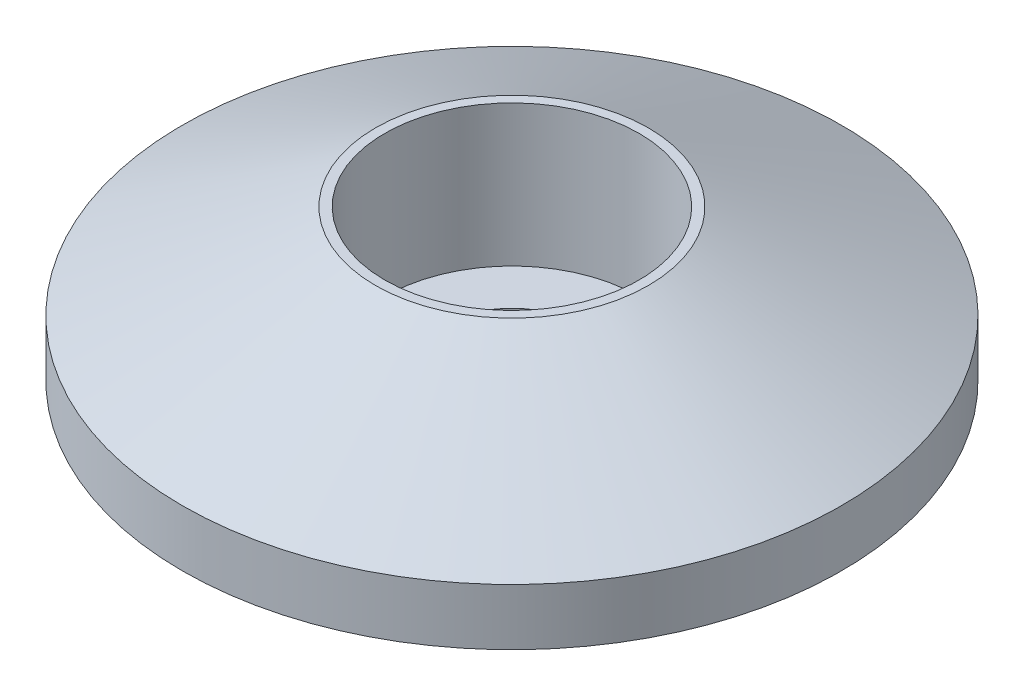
from build123d import *

# Parameters (mm, degrees)
ESQUISSE1_R             = 7
ESQUISSE1_R_2           = 1.6
EXTRUSION1_DEPTH        = 3.2
ESQUISSE2_R             = 2.7
ENL_V_MAT_EXTRU_1_DEPTH = 3
CHANFREIN1_SIZE         = 2
CHANFREIN1_SIZE2        = 4.100607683


with BuildPart() as part:
    # Esquisse1 → Extrusion1 (new body)
    with BuildSketch(Plane(origin=(0, 0, 0), x_dir=(1, 0, 0), z_dir=(0, 1, 0))):
        with Locations(Location((0, 0, 0), (0, 0, 270))):
            Circle(ESQUISSE1_R)
        with Locations(Location((0, 0, 0), (0, 0, 270))):
            Circle(ESQUISSE1_R_2, mode=Mode.SUBTRACT)
    extrude(amount=EXTRUSION1_DEPTH)

    # Esquisse2 → Enl_v. mat.-Extru.1 (cut)
    with BuildSketch(Plane(origin=(0, 3.2, 0), x_dir=(-1, 0, 0), z_dir=(0, 1, 0))):
        with Locations(Location((0, 0, 0), (0, 0, 90))):
            Circle(ESQUISSE2_R)
    extrude(amount=-ENL_V_MAT_EXTRU_1_DEPTH, mode=Mode.SUBTRACT)

    # Chanfrein1
    chanfrein1_edges = [part.edges().sort_by_distance(p)[0] for p in [
        (0, 3.2, -7),
    ]]
    chanfrein1_side = [part.faces().sort_by_distance(p)[0] for p in [
        (0, 1.6, -7),
    ]]
    chamfer(chanfrein1_edges, length=CHANFREIN1_SIZE, length2=CHANFREIN1_SIZE2, reference=chanfrein1_side[0])


solid = part.part
